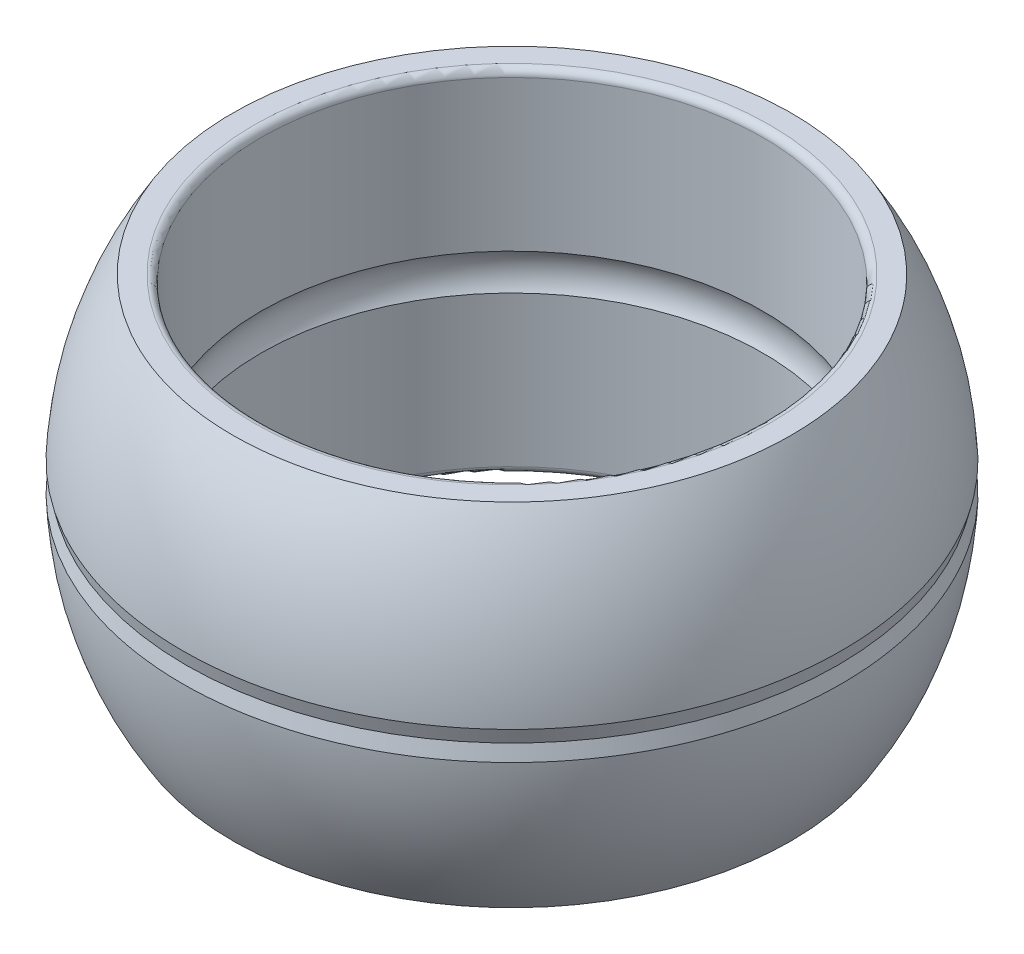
ISO-10303-21;
HEADER;
FILE_DESCRIPTION(('STEP AP214'),'2;1');
FILE_NAME('part.step','',(''),(''),'','','');
FILE_SCHEMA(('AUTOMOTIVE_DESIGN { 1 0 10303 214 1 1 1 1 }'));
ENDSEC;
DATA;
#1=APPLICATION_CONTEXT('core data for automotive mechanical design processes');
#2=APPLICATION_PROTOCOL_DEFINITION('international standard','automotive_design',2000,#1);
#3=PRODUCT_CONTEXT('',#1,'mechanical');
#4=PRODUCT('Part','Part','',(#3));
#5=PRODUCT_RELATED_PRODUCT_CATEGORY('part','',(#4));
#6=PRODUCT_DEFINITION_FORMATION('','',#4);
#7=PRODUCT_DEFINITION_CONTEXT('part definition',#1,'design');
#8=PRODUCT_DEFINITION('design','',#6,#7);
#9=PRODUCT_DEFINITION_SHAPE('','',#8);
#10=(LENGTH_UNIT() NAMED_UNIT(*) SI_UNIT(.MILLI.,.METRE.));
#11=(NAMED_UNIT(*) PLANE_ANGLE_UNIT() SI_UNIT($,.RADIAN.));
#12=(NAMED_UNIT(*) SI_UNIT($,.STERADIAN.) SOLID_ANGLE_UNIT());
#13=UNCERTAINTY_MEASURE_WITH_UNIT(LENGTH_MEASURE(1.E-05),#10,'distance_accuracy_value','');
#14=(GEOMETRIC_REPRESENTATION_CONTEXT(3) GLOBAL_UNCERTAINTY_ASSIGNED_CONTEXT((#13)) GLOBAL_UNIT_ASSIGNED_CONTEXT((#10,
#11,#12)) REPRESENTATION_CONTEXT('',''));
#15=CARTESIAN_POINT('',(0.,0.,0.));
#16=DIRECTION('',(0.,0.,1.));
#17=DIRECTION('',(1.,0.,0.));
#18=AXIS2_PLACEMENT_3D('',#15,#16,#17);
#19=CARTESIAN_POINT('',(0.,-23.5,0.));
#20=DIRECTION('',(0.,1.,0.));
#21=DIRECTION('',(0.,0.,1.));
#22=AXIS2_PLACEMENT_3D('',#19,#20,#21);
#23=CYLINDRICAL_SURFACE('',#22,35.00000000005);
#24=CARTESIAN_POINT('',(0.,-23.5,0.));
#25=DIRECTION('',(0.,1.,0.));
#26=DIRECTION('',(-1.,0.,0.));
#27=AXIS2_PLACEMENT_3D('',#24,#25,#26);
#28=CIRCLE('',#27,35.0000000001);
#29=CARTESIAN_POINT('',(-35.0000000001,-23.5,0.));
#30=VERTEX_POINT('',#29);
#31=EDGE_CURVE('E229',#30,#30,#28,.T.);
#32=ORIENTED_EDGE('',*,*,#31,.F.);
#33=EDGE_LOOP('',(#32));
#34=FACE_BOUND('',#33,.T.);
#35=CARTESIAN_POINT('',(0.,-2.5298221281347,0.));
#36=DIRECTION('',(0.,1.,0.));
#37=DIRECTION('',(-1.,0.,0.));
#38=AXIS2_PLACEMENT_3D('',#35,#36,#37);
#39=CIRCLE('',#38,35.);
#40=CARTESIAN_POINT('',(-35.,-2.5298221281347,0.));
#41=VERTEX_POINT('',#40);
#42=EDGE_CURVE('E105',#41,#41,#39,.F.);
#43=ORIENTED_EDGE('',*,*,#42,.F.);
#44=EDGE_LOOP('',(#43));
#45=FACE_BOUND('',#44,.T.);
#46=ADVANCED_FACE('F14',(#34,#45),#23,.F.);
#47=CARTESIAN_POINT('',(0.,-23.4999999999,0.));
#48=DIRECTION('',(0.,1.,0.));
#49=DIRECTION('',(-1.,0.,0.));
#50=AXIS2_PLACEMENT_3D('',#47,#48,#49);
#51=TOROIDAL_SURFACE('',#50,36.0000000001,1.);
#52=ORIENTED_EDGE('',*,*,#31,.T.);
#53=EDGE_LOOP('',(#52));
#54=FACE_BOUND('',#53,.T.);
#55=CARTESIAN_POINT('',(0.,-24.4999999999,0.));
#56=DIRECTION('',(0.,-1.,0.));
#57=DIRECTION('',(1.,0.,0.));
#58=AXIS2_PLACEMENT_3D('',#55,#56,#57);
#59=CIRCLE('',#58,36.);
#60=CARTESIAN_POINT('',(36.,-24.4999999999,0.));
#61=VERTEX_POINT('',#60);
#62=EDGE_CURVE('E101',#61,#61,#59,.F.);
#63=ORIENTED_EDGE('',*,*,#62,.F.);
#64=EDGE_LOOP('',(#63));
#65=FACE_BOUND('',#64,.T.);
#66=ADVANCED_FACE('F202',(#54,#65),#51,.T.);
#67=CARTESIAN_POINT('',(0.,0.,0.));
#68=DIRECTION('',(0.,1.,0.));
#69=DIRECTION('',(-1.,0.,0.));
#70=AXIS2_PLACEMENT_3D('',#67,#68,#69);
#71=TOROIDAL_SURFACE('',#70,30.6,5.07543101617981);
#72=CARTESIAN_POINT('',(0.,2.5298221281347,0.));
#73=DIRECTION('',(0.,-1.,0.));
#74=DIRECTION('',(1.,0.,0.));
#75=AXIS2_PLACEMENT_3D('',#72,#73,#74);
#76=CIRCLE('',#75,35.);
#77=CARTESIAN_POINT('',(35.,2.5298221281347,0.));
#78=VERTEX_POINT('',#77);
#79=EDGE_CURVE('E97',#78,#78,#76,.T.);
#80=ORIENTED_EDGE('',*,*,#79,.F.);
#81=EDGE_LOOP('',(#80));
#82=FACE_BOUND('',#81,.T.);
#83=ORIENTED_EDGE('',*,*,#42,.T.);
#84=EDGE_LOOP('',(#83));
#85=FACE_BOUND('',#84,.T.);
#86=ADVANCED_FACE('F121',(#82,#85),#71,.F.);
#87=CARTESIAN_POINT('',(37.4663170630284,-24.4999999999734,0.));
#88=DIRECTION('',(0.,-1.,0.));
#89=DIRECTION('',(0.,0.,-1.));
#90=AXIS2_PLACEMENT_3D('',#87,#88,#89);
#91=PLANE('',#90);
#92=ORIENTED_EDGE('',*,*,#62,.T.);
#93=EDGE_LOOP('',(#92));
#94=FACE_BOUND('',#93,.T.);
#95=CARTESIAN_POINT('',(38.9326341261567,-24.4999999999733,0.));
#96=CARTESIAN_POINT('',(38.9326419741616,-24.4999999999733,-1.09382528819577));
#97=CARTESIAN_POINT('',(38.8865180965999,-24.4999999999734,-2.18752178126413));
#98=CARTESIAN_POINT('',(38.7023445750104,-24.4999999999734,-4.36750600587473));
#99=CARTESIAN_POINT('',(38.5642707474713,-24.4999999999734,-5.45379171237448));
#100=CARTESIAN_POINT('',(38.1969408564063,-24.4999999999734,-7.6120567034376));
#101=CARTESIAN_POINT('',(37.9675839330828,-24.4999999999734,-8.68401880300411));
#102=CARTESIAN_POINT('',(37.4193429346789,-24.4999999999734,-10.8047281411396));
#103=CARTESIAN_POINT('',(37.1004648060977,-24.4999999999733,-11.8534769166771));
#104=CARTESIAN_POINT('',(36.3756084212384,-24.4999999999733,-13.9198942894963));
#105=CARTESIAN_POINT('',(35.9696696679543,-24.4999999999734,-14.937576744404));
#106=CARTESIAN_POINT('',(35.0734864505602,-24.4999999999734,-16.9351383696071));
#107=CARTESIAN_POINT('',(34.5832406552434,-24.4999999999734,-17.9150169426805));
#108=CARTESIAN_POINT('',(33.5220694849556,-24.4999999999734,-19.8297407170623));
#109=CARTESIAN_POINT('',(32.951164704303,-24.4999999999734,-20.7645973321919));
#110=CARTESIAN_POINT('',(31.7326415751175,-24.4999999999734,-22.5828963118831));
#111=CARTESIAN_POINT('',(31.0850235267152,-24.4999999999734,-23.4663388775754));
#112=CARTESIAN_POINT('',(29.7176023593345,-24.4999999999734,-25.1756253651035));
#113=CARTESIAN_POINT('',(28.997791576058,-24.4999999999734,-26.0014631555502));
#114=CARTESIAN_POINT('',(27.4911588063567,-24.4999999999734,-27.5895667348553));
#115=CARTESIAN_POINT('',(26.704336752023,-24.4999999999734,-28.3518324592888));
#116=CARTESIAN_POINT('',(25.069243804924,-24.4999999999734,-29.8074003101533));
#117=CARTESIAN_POINT('',(24.2209705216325,-24.4999999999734,-30.5006997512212));
#118=CARTESIAN_POINT('',(22.4690333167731,-24.4999999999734,-31.8133720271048));
#119=CARTESIAN_POINT('',(21.5653694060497,-24.4999999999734,-32.432744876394));
#120=CARTESIAN_POINT('',(19.7090928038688,-24.4999999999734,-33.5931498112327));
#121=CARTESIAN_POINT('',(18.756481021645,-24.4999999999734,-34.1341833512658));
#122=CARTESIAN_POINT('',(16.8090657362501,-24.4999999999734,-35.1340769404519));
#123=CARTESIAN_POINT('',(15.8142622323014,-24.4999999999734,-35.5929369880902));
#124=CARTESIAN_POINT('',(13.7895380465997,-24.4999999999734,-36.4252205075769));
#125=CARTESIAN_POINT('',(12.759617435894,-24.4999999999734,-36.7986441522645));
#126=CARTESIAN_POINT('',(10.6719792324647,-24.4999999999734,-37.457401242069));
#127=CARTESIAN_POINT('',(9.61426163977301,-24.4999999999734,-37.7427346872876));
#128=CARTESIAN_POINT('',(7.47854715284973,-24.4999999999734,-38.2232832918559));
#129=CARTESIAN_POINT('',(6.40055021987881,-24.4999999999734,-38.4184982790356));
#130=CARTESIAN_POINT('',(4.23194294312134,-24.4999999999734,-38.7174212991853));
#131=CARTESIAN_POINT('',(3.14133259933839,-24.4999999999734,-38.8211293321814));
#132=CARTESIAN_POINT('',(0.955254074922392,-24.4999999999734,-38.9363010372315));
#133=CARTESIAN_POINT('',(-0.140214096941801,-24.4999999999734,-38.9477648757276));
#134=CARTESIAN_POINT('',(-2.32822212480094,-24.4999999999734,-38.8783671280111));
#135=CARTESIAN_POINT('',(-3.42076198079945,-24.4999999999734,-38.7975055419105));
#136=CARTESIAN_POINT('',(-5.59514649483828,-24.4999999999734,-38.5440317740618));
#137=CARTESIAN_POINT('',(-6.67699114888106,-24.4999999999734,-38.3714195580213));
#138=CARTESIAN_POINT('',(-8.82229358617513,-24.4999999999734,-37.9356716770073));
#139=CARTESIAN_POINT('',(-9.88575136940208,-24.4999999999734,-37.6725360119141));
#140=CARTESIAN_POINT('',(-11.9867206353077,-24.4999999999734,-37.0576116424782));
#141=CARTESIAN_POINT('',(-13.024232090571,-24.4999999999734,-36.7058228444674));
#142=CARTESIAN_POINT('',(-15.065931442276,-24.4999999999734,-35.9160933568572));
#143=CARTESIAN_POINT('',(-16.0701193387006,-24.4999999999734,-35.4781526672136));
#144=CARTESIAN_POINT('',(-18.0380320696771,-24.4999999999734,-34.519233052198));
#145=CARTESIAN_POINT('',(-19.0017569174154,-24.4999999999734,-33.9982541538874));
#146=CARTESIAN_POINT('',(-20.8818923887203,-24.4999999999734,-32.8769618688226));
#147=CARTESIAN_POINT('',(-21.7983030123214,-24.4999999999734,-32.2766484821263));
#148=CARTESIAN_POINT('',(-23.5772945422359,-24.4999999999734,-31.0009553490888));
#149=CARTESIAN_POINT('',(-24.4398754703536,-24.4999999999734,-30.3255756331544));
#150=CARTESIAN_POINT('',(-26.1050755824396,-24.4999999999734,-28.9045511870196));
#151=CARTESIAN_POINT('',(-26.907694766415,-24.4999999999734,-28.1589064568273));
#152=CARTESIAN_POINT('',(-28.4472653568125,-24.4999999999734,-26.6026529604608));
#153=CARTESIAN_POINT('',(-29.1842167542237,-24.4999999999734,-25.7920441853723));
#154=CARTESIAN_POINT('',(-30.5872123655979,-24.4999999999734,-24.1116256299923));
#155=CARTESIAN_POINT('',(-31.2532565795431,-24.4999999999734,-23.2418158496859));
#156=CARTESIAN_POINT('',(-32.5097027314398,-24.4999999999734,-21.4491789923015));
#157=CARTESIAN_POINT('',(-33.1001046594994,-24.4999999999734,-20.5263519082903));
#158=CARTESIAN_POINT('',(-34.2010687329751,-24.4999999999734,-18.6342412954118));
#159=CARTESIAN_POINT('',(-34.7116308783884,-24.4999999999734,-17.664957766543));
#160=CARTESIAN_POINT('',(-35.6492855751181,-24.4999999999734,-15.6868253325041));
#161=CARTESIAN_POINT('',(-36.0763781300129,-24.4999999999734,-14.6779764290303));
#162=CARTESIAN_POINT('',(-36.8440573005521,-24.4999999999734,-12.6278855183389));
#163=CARTESIAN_POINT('',(-37.1846439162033,-24.4999999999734,-11.5866435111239));
#164=CARTESIAN_POINT('',(-37.7768898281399,-24.4999999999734,-9.47916904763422));
#165=CARTESIAN_POINT('',(-38.0285491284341,-24.4999999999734,-8.41293659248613));
#166=CARTESIAN_POINT('',(-38.4411512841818,-24.4999999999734,-6.26306146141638));
#167=CARTESIAN_POINT('',(-38.6020941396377,-24.4999999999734,-5.17941878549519));
#168=CARTESIAN_POINT('',(-38.8321191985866,-24.4999999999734,-3.00242726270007));
#169=CARTESIAN_POINT('',(-38.9012014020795,-24.4999999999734,-1.90907841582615));
#170=CARTESIAN_POINT('',(-38.9470140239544,-24.4999999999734,0.279552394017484));
#171=CARTESIAN_POINT('',(-38.9237444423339,-24.4999999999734,1.37483435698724));
#172=CARTESIAN_POINT('',(-38.7850189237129,-24.4999999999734,3.55954465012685));
#173=CARTESIAN_POINT('',(-38.6695629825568,-24.4999999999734,4.64897298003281));
#174=CARTESIAN_POINT('',(-38.3472855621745,-24.4999999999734,6.81423077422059));
#175=CARTESIAN_POINT('',(-38.1404640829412,-24.4999999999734,7.89006023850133));
#176=CARTESIAN_POINT('',(-37.6369259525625,-24.4999999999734,10.0204718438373));
#177=CARTESIAN_POINT('',(-37.3402092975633,-24.4999999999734,11.0750539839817));
#178=CARTESIAN_POINT('',(-36.6589902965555,-24.4999999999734,13.1554734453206));
#179=CARTESIAN_POINT('',(-36.2744879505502,-24.4999999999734,14.1813107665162));
#180=CARTESIAN_POINT('',(-35.4204312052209,-24.4999999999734,16.1969473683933));
#181=CARTESIAN_POINT('',(-34.9508768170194,-24.4999999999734,17.1867466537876));
#182=CARTESIAN_POINT('',(-33.9300542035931,-24.4999999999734,19.1232704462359));
#183=CARTESIAN_POINT('',(-33.3787859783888,-24.4999999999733,20.0699949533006));
#184=CARTESIAN_POINT('',(-32.1984549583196,-24.4999999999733,21.9136384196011));
#185=CARTESIAN_POINT('',(-31.5693921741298,-24.4999999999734,22.810557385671));
#186=CARTESIAN_POINT('',(-30.2379442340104,-24.4999999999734,24.5482133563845));
#187=CARTESIAN_POINT('',(-29.5355590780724,-24.4999999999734,25.3889503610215));
#188=CARTESIAN_POINT('',(-28.0624596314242,-24.4999999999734,27.0082656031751));
#189=CARTESIAN_POINT('',(-27.2917453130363,-24.4999999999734,27.7868438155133));
#190=CARTESIAN_POINT('',(-25.6874671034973,-24.4999999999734,29.2763058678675));
#191=CARTESIAN_POINT('',(-24.8539032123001,-24.4999999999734,29.9871897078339));
#192=CARTESIAN_POINT('',(-23.1298517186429,-24.4999999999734,31.3362092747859));
#193=CARTESIAN_POINT('',(-22.239364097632,-24.4999999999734,31.9743449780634));
#194=CARTESIAN_POINT('',(-20.4077962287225,-24.4999999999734,33.173331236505));
#195=CARTESIAN_POINT('',(-19.4667159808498,-24.4999999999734,33.7341817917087));
#196=CARTESIAN_POINT('',(-17.5406544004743,-24.4999999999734,34.7746098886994));
#197=CARTESIAN_POINT('',(-16.5556731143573,-24.4999999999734,35.2541875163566));
#198=CARTESIAN_POINT('',(-14.5488111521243,-24.4999999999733,36.1286609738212));
#199=CARTESIAN_POINT('',(-13.5269304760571,-24.4999999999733,36.5235568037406));
#200=CARTESIAN_POINT('',(-11.4535350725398,-24.4999999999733,37.2258590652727));
#201=CARTESIAN_POINT('',(-10.4020203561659,-24.4999999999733,37.5332655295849));
#202=CARTESIAN_POINT('',(-8.2768321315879,-24.4999999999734,38.0584037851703));
#203=CARTESIAN_POINT('',(-7.20315862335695,-24.4999999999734,38.2761355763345));
#204=CARTESIAN_POINT('',(-5.04128402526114,-24.4999999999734,38.6203768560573));
#205=CARTESIAN_POINT('',(-3.9530829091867,-24.4999999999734,38.7468861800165));
#206=CARTESIAN_POINT('',(-1.76989146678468,-24.4999999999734,38.9077824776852));
#207=CARTESIAN_POINT('',(-0.674901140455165,-24.4999999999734,38.9421694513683));
#208=CARTESIAN_POINT('',(1.51408189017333,-24.4999999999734,38.9185766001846));
#209=CARTESIAN_POINT('',(2.60807459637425,-24.4999999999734,38.860596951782));
#210=CARTESIAN_POINT('',(4.78728686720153,-24.4999999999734,38.6526833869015));
#211=CARTESIAN_POINT('',(5.87250643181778,-24.4999999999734,38.5027494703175));
#212=CARTESIAN_POINT('',(8.02645935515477,-24.4999999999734,38.1119929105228));
#213=CARTESIAN_POINT('',(9.09519268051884,-24.4999999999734,37.8711700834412));
#214=CARTESIAN_POINT('',(11.2085727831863,-24.4999999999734,37.3003478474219));
#215=CARTESIAN_POINT('',(12.2532195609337,-24.4999999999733,36.9703484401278));
#216=CARTESIAN_POINT('',(14.3110188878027,-24.4999999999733,36.2235122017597));
#217=CARTESIAN_POINT('',(15.3241708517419,-24.4999999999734,35.8066737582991));
#218=CARTESIAN_POINT('',(17.3117572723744,-24.4999999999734,34.8891266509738));
#219=CARTESIAN_POINT('',(18.2861917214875,-24.4999999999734,34.3884179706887));
#220=CARTESIAN_POINT('',(20.1893779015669,-24.4999999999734,33.3067114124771));
#221=CARTESIAN_POINT('',(21.1181314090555,-24.4999999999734,32.725716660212));
#222=CARTESIAN_POINT('',(22.9233928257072,-24.4999999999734,31.4875541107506));
#223=CARTESIAN_POINT('',(23.7999007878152,-24.4999999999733,30.8303863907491));
#224=CARTESIAN_POINT('',(25.4943508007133,-24.4999999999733,29.4446230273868));
#225=CARTESIAN_POINT('',(26.3122990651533,-24.4999999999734,28.7160349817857));
#226=CARTESIAN_POINT('',(27.883921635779,-24.4999999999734,27.1925480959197));
#227=CARTESIAN_POINT('',(28.6375956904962,-24.4999999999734,26.3976489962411));
#228=CARTESIAN_POINT('',(30.0754928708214,-24.4999999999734,24.7469815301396));
#229=CARTESIAN_POINT('',(30.7596982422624,-24.4999999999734,23.8911976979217));
#230=CARTESIAN_POINT('',(32.0535631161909,-24.4999999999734,22.1250407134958));
#231=CARTESIAN_POINT('',(32.6632237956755,-24.4999999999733,21.2146684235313));
#232=CARTESIAN_POINT('',(33.8039353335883,-24.4999999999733,19.3453705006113));
#233=CARTESIAN_POINT('',(34.3349504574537,-24.4999999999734,18.3864230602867));
#234=CARTESIAN_POINT('',(35.3142931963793,-24.4999999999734,16.4271211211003));
#235=CARTESIAN_POINT('',(35.7626153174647,-24.4999999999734,15.4267638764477));
#236=CARTESIAN_POINT('',(36.5728906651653,-24.4999999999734,13.3929268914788));
#237=CARTESIAN_POINT('',(36.9349389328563,-24.4999999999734,12.3594850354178));
#238=CARTESIAN_POINT('',(37.5706415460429,-24.4999999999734,10.266130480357));
#239=CARTESIAN_POINT('',(37.8443191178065,-24.4999999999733,9.20622481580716));
#240=CARTESIAN_POINT('',(38.3583881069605,-24.4999999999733,6.80068626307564));
#241=CARTESIAN_POINT('',(38.5735476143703,-24.4999999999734,5.44958736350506));
#242=CARTESIAN_POINT('',(38.8606657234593,-24.4999999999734,2.73225868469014));
#243=CARTESIAN_POINT('',(38.9326243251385,-24.4999999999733,1.36602890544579));
#244=CARTESIAN_POINT('',(38.9326341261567,-24.4999999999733,0.));
#245=B_SPLINE_CURVE_WITH_KNOTS('',3,(#95,#96,#97,#98,#99,#100,#101,#102,#103,#104,#105,#106,
#107,#108,#109,#110,#111,#112,#113,#114,#115,#116,#117,#118,#119,#120,#121,#122,#123,#124,#125,
#126,#127,#128,#129,#130,#131,#132,#133,#134,#135,#136,#137,#138,#139,#140,#141,#142,#143,#144,
#145,#146,#147,#148,#149,#150,#151,#152,#153,#154,#155,#156,#157,#158,#159,#160,#161,#162,#163,
#164,#165,#166,#167,#168,#169,#170,#171,#172,#173,#174,#175,#176,#177,#178,#179,#180,#181,#182,
#183,#184,#185,#186,#187,#188,#189,#190,#191,#192,#193,#194,#195,#196,#197,#198,#199,#200,#201,
#202,#203,#204,#205,#206,#207,#208,#209,#210,#211,#212,#213,#214,#215,#216,#217,#218,#219,#220,
#221,#222,#223,#224,#225,#226,#227,#228,#229,#230,#231,#232,#233,#234,#235,#236,#237,#238,#239,
#240,#241,#242,#243,#244),.UNSPECIFIED.,.T.,.F.,(4,2,2,2,2,2,2,2,2,2,2,2,2,2,2,2,2,2,2,2,2,2,2,
2,2,2,2,2,2,2,2,2,2,2,2,2,2,2,2,2,2,2,2,2,2,2,2,2,2,2,2,2,2,2,2,2,2,2,2,2,2,2,2,2,2,2,2,2,2,2,2,
2,2,2,4),(0.,3.28028263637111,6.56142835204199,9.84620955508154,13.1307726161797,
16.4138484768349,19.6969761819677,22.9792671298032,26.2615452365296,29.5441721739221,
32.8268024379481,36.1095604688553,39.3923178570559,42.6750142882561,45.9577107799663,
49.240400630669,52.5230904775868,55.8057865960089,59.0884827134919,62.3711729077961,
65.6538630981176,68.9365545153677,72.2192459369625,75.5019408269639,78.7846357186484,
82.0673295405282,85.3500233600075,88.6327158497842,91.9154083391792,95.1981012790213,
98.4807942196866,101.763487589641,105.04618095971,108.328874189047,111.611567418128,
114.894260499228,118.176953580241,121.459646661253,124.742339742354,128.025032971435,
131.307726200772,134.590419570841,137.873112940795,141.15580588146,144.438498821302,
147.721191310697,151.003883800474,154.286577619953,157.569271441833,160.851966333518,
164.134661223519,167.417352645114,170.700044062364,173.982734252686,177.26542444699,
180.548120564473,183.830816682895,187.113506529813,190.396196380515,193.678892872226,
196.961589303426,200.244346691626,203.527104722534,206.80973498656,210.092361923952,
213.374640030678,216.656930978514,219.940058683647,223.223134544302,226.5076976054,
229.79247880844,233.073624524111,236.353907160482,240.450503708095,244.547100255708),.UNSPECIFIED.);
#246=CARTESIAN_POINT('',(38.9326341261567,-24.4999999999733,0.));
#247=VERTEX_POINT('',#246);
#248=EDGE_CURVE('E20',#247,#247,#245,.T.);
#249=ORIENTED_EDGE('',*,*,#248,.F.);
#250=EDGE_LOOP('',(#249));
#251=FACE_BOUND('',#250,.T.);
#252=ADVANCED_FACE('F111',(#94,#251),#91,.T.);
#253=CARTESIAN_POINT('',(0.,2.5298221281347,0.));
#254=DIRECTION('',(0.,1.,0.));
#255=DIRECTION('',(0.,0.,1.));
#256=AXIS2_PLACEMENT_3D('',#253,#254,#255);
#257=CYLINDRICAL_SURFACE('',#256,35.);
#258=ORIENTED_EDGE('',*,*,#79,.T.);
#259=EDGE_LOOP('',(#258));
#260=FACE_BOUND('',#259,.T.);
#261=CARTESIAN_POINT('',(0.,23.5,0.));
#262=DIRECTION('',(0.,1.,0.));
#263=DIRECTION('',(-1.,0.,0.));
#264=AXIS2_PLACEMENT_3D('',#261,#262,#263);
#265=CIRCLE('',#264,35.0000000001);
#266=CARTESIAN_POINT('',(-35.0000000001,23.5,0.));
#267=VERTEX_POINT('',#266);
#268=EDGE_CURVE('E91',#267,#267,#265,.F.);
#269=ORIENTED_EDGE('',*,*,#268,.F.);
#270=EDGE_LOOP('',(#269));
#271=FACE_BOUND('',#270,.T.);
#272=ADVANCED_FACE('F120',(#260,#271),#257,.F.);
#273=CARTESIAN_POINT('',(-9.86588588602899E-11,3.08819636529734E-11,0.));
#274=DIRECTION('',(0.457831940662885,0.797007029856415,0.39391586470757));
#275=DIRECTION('',(-0.209259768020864,-0.334023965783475,0.919042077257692));
#276=AXIS2_PLACEMENT_3D('',#273,#274,#275);
#277=SPHERICAL_SURFACE('',#276,46.0000000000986);
#278=ORIENTED_EDGE('',*,*,#248,.T.);
#279=EDGE_LOOP('',(#278));
#280=FACE_BOUND('',#279,.T.);
#281=CARTESIAN_POINT('',(0.,-2.,0.));
#282=DIRECTION('',(0.,-1.,0.));
#283=DIRECTION('',(0.,0.,-1.));
#284=AXIS2_PLACEMENT_3D('',#281,#282,#283);
#285=CIRCLE('',#284,45.9565011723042);
#286=CARTESIAN_POINT('',(0.,-2.,-45.9565011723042));
#287=VERTEX_POINT('',#286);
#288=EDGE_CURVE('E43',#287,#287,#285,.F.);
#289=ORIENTED_EDGE('',*,*,#288,.F.);
#290=EDGE_LOOP('',(#289));
#291=FACE_BOUND('',#290,.T.);
#292=ADVANCED_FACE('F84',(#280,#291),#277,.T.);
#293=CARTESIAN_POINT('',(0.,23.4999999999,0.));
#294=DIRECTION('',(0.,1.,0.));
#295=DIRECTION('',(-1.,0.,0.));
#296=AXIS2_PLACEMENT_3D('',#293,#294,#295);
#297=TOROIDAL_SURFACE('',#296,36.0000000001,1.00000000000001);
#298=CARTESIAN_POINT('',(0.,24.4999999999,0.));
#299=DIRECTION('',(0.,1.,0.));
#300=DIRECTION('',(1.,0.,0.));
#301=AXIS2_PLACEMENT_3D('',#298,#299,#300);
#302=CIRCLE('',#301,36.);
#303=CARTESIAN_POINT('',(36.,24.4999999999,0.));
#304=VERTEX_POINT('',#303);
#305=EDGE_CURVE('E68',#304,#304,#302,.F.);
#306=ORIENTED_EDGE('',*,*,#305,.F.);
#307=EDGE_LOOP('',(#306));
#308=FACE_BOUND('',#307,.T.);
#309=ORIENTED_EDGE('',*,*,#268,.T.);
#310=EDGE_LOOP('',(#309));
#311=FACE_BOUND('',#310,.T.);
#312=ADVANCED_FACE('F75',(#308,#311),#297,.T.);
#313=CARTESIAN_POINT('',(0.,-2.00000000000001,0.));
#314=DIRECTION('',(0.,-1.,0.));
#315=DIRECTION('',(0.,0.,-1.));
#316=AXIS2_PLACEMENT_3D('',#313,#314,#315);
#317=CONICAL_SURFACE('',#316,45.9565011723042,0.241398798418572);
#318=CARTESIAN_POINT('',(0.,1.14630527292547E-11,0.));
#319=DIRECTION('',(0.,1.,0.));
#320=DIRECTION('',(1.,0.,0.));
#321=AXIS2_PLACEMENT_3D('',#318,#319,#320);
#322=CIRCLE('',#321,45.4641016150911);
#323=CARTESIAN_POINT('',(45.4641016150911,1.14723768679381E-11,0.));
#324=VERTEX_POINT('',#323);
#325=EDGE_CURVE('E33',#324,#324,#322,.T.);
#326=ORIENTED_EDGE('',*,*,#325,.F.);
#327=EDGE_LOOP('',(#326));
#328=FACE_BOUND('',#327,.T.);
#329=ORIENTED_EDGE('',*,*,#288,.T.);
#330=EDGE_LOOP('',(#329));
#331=FACE_BOUND('',#330,.T.);
#332=ADVANCED_FACE('F49',(#328,#331),#317,.T.);
#333=CARTESIAN_POINT('',(37.4663170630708,24.49999999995,0.));
#334=DIRECTION('',(0.,1.,0.));
#335=DIRECTION('',(0.,0.,1.));
#336=AXIS2_PLACEMENT_3D('',#333,#334,#335);
#337=PLANE('',#336);
#338=CARTESIAN_POINT('',(38.9326341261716,24.49999999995,0.));
#339=CARTESIAN_POINT('',(38.9326419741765,24.49999999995,1.09382528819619));
#340=CARTESIAN_POINT('',(38.8865180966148,24.49999999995,2.18752178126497));
#341=CARTESIAN_POINT('',(38.7023445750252,24.49999999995,4.36750600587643));
#342=CARTESIAN_POINT('',(38.5642707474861,24.49999999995,5.4537917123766));
#343=CARTESIAN_POINT('',(38.1969408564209,24.49999999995,7.61205670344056));
#344=CARTESIAN_POINT('',(37.9675839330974,24.49999999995,8.68401880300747));
#345=CARTESIAN_POINT('',(37.4193429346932,24.49999999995,10.8047281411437));
#346=CARTESIAN_POINT('',(37.1004648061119,24.49999999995,11.8534769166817));
#347=CARTESIAN_POINT('',(36.3756084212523,24.49999999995,13.9198942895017));
#348=CARTESIAN_POINT('',(35.969669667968,24.49999999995,14.9375767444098));
#349=CARTESIAN_POINT('',(35.0734864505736,24.49999999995,16.9351383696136));
#350=CARTESIAN_POINT('',(34.5832406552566,24.49999999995,17.9150169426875));
#351=CARTESIAN_POINT('',(33.5220694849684,24.49999999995,19.82974071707));
#352=CARTESIAN_POINT('',(32.9511647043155,24.49999999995,20.7645973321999));
#353=CARTESIAN_POINT('',(31.7326415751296,24.49999999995,22.5828963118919));
#354=CARTESIAN_POINT('',(31.0850235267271,24.49999999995,23.4663388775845));
#355=CARTESIAN_POINT('',(29.7176023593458,24.49999999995,25.1756253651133));
#356=CARTESIAN_POINT('',(28.997791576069,24.49999999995,26.0014631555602));
#357=CARTESIAN_POINT('',(27.4911588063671,24.49999999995,27.589566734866));
#358=CARTESIAN_POINT('',(26.7043367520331,24.49999999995,28.3518324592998));
#359=CARTESIAN_POINT('',(25.0692438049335,24.49999999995,29.8074003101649));
#360=CARTESIAN_POINT('',(24.2209705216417,24.49999999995,30.500699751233));
#361=CARTESIAN_POINT('',(22.4690333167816,24.49999999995,31.8133720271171));
#362=CARTESIAN_POINT('',(21.5653694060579,24.49999999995,32.4327448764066));
#363=CARTESIAN_POINT('',(19.7090928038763,24.49999999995,33.5931498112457));
#364=CARTESIAN_POINT('',(18.7564810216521,24.49999999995,34.1341833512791));
#365=CARTESIAN_POINT('',(16.8090657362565,24.49999999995,35.1340769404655));
#366=CARTESIAN_POINT('',(15.8142622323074,24.49999999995,35.592936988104));
#367=CARTESIAN_POINT('',(13.7895380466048,24.49999999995,36.4252205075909));
#368=CARTESIAN_POINT('',(12.7596174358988,24.49999999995,36.7986441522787));
#369=CARTESIAN_POINT('',(10.6719792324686,24.49999999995,37.4574012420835));
#370=CARTESIAN_POINT('',(9.61426163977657,24.49999999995,37.7427346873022));
#371=CARTESIAN_POINT('',(7.47854715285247,24.49999999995,38.2232832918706));
#372=CARTESIAN_POINT('',(6.40055021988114,24.49999999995,38.4184982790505));
#373=CARTESIAN_POINT('',(4.23194294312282,24.49999999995,38.7174212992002));
#374=CARTESIAN_POINT('',(3.14133259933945,24.49999999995,38.8211293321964));
#375=CARTESIAN_POINT('',(0.955254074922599,24.49999999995,38.9363010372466));
#376=CARTESIAN_POINT('',(-0.14021409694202,24.49999999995,38.9477648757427));
#377=CARTESIAN_POINT('',(-2.32822212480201,24.49999999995,38.8783671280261));
#378=CARTESIAN_POINT('',(-3.42076198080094,24.49999999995,38.7975055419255));
#379=CARTESIAN_POINT('',(-5.59514649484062,24.49999999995,38.5440317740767));
#380=CARTESIAN_POINT('',(-6.67699114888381,24.49999999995,38.3714195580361));
#381=CARTESIAN_POINT('',(-8.8222935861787,24.49999999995,37.935671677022));
#382=CARTESIAN_POINT('',(-9.88575136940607,24.49999999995,37.6725360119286));
#383=CARTESIAN_POINT('',(-11.9867206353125,24.49999999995,37.0576116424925));
#384=CARTESIAN_POINT('',(-13.0242320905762,24.49999999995,36.7058228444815));
#385=CARTESIAN_POINT('',(-15.065931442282,24.49999999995,35.9160933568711));
#386=CARTESIAN_POINT('',(-16.070119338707,24.49999999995,35.4781526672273));
#387=CARTESIAN_POINT('',(-18.0380320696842,24.49999999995,34.5192330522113));
#388=CARTESIAN_POINT('',(-19.0017569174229,24.49999999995,33.9982541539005));
#389=CARTESIAN_POINT('',(-20.8818923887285,24.49999999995,32.8769618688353));
#390=CARTESIAN_POINT('',(-21.79830301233,24.49999999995,32.2766484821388));
#391=CARTESIAN_POINT('',(-23.5772945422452,24.49999999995,31.0009553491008));
#392=CARTESIAN_POINT('',(-24.4398754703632,24.49999999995,30.3255756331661));
#393=CARTESIAN_POINT('',(-26.1050755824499,24.49999999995,28.9045511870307));
#394=CARTESIAN_POINT('',(-26.9076947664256,24.49999999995,28.1589064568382));
#395=CARTESIAN_POINT('',(-28.4472653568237,24.49999999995,26.6026529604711));
#396=CARTESIAN_POINT('',(-29.1842167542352,24.49999999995,25.7920441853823));
#397=CARTESIAN_POINT('',(-30.5872123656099,24.49999999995,24.1116256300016));
#398=CARTESIAN_POINT('',(-31.2532565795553,24.49999999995,23.2418158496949));
#399=CARTESIAN_POINT('',(-32.5097027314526,24.49999999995,21.4491789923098));
#400=CARTESIAN_POINT('',(-33.1001046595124,24.49999999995,20.5263519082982));
#401=CARTESIAN_POINT('',(-34.2010687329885,24.49999999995,18.6342412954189));
#402=CARTESIAN_POINT('',(-34.711630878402,24.49999999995,17.6649577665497));
#403=CARTESIAN_POINT('',(-35.649285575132,24.49999999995,15.6868253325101));
#404=CARTESIAN_POINT('',(-36.076378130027,24.49999999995,14.677976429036));
#405=CARTESIAN_POINT('',(-36.8440573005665,24.49999999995,12.6278855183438));
#406=CARTESIAN_POINT('',(-37.1846439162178,24.49999999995,11.5866435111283));
#407=CARTESIAN_POINT('',(-37.7768898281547,24.49999999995,9.47916904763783));
#408=CARTESIAN_POINT('',(-38.028549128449,24.49999999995,8.41293659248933));
#409=CARTESIAN_POINT('',(-38.4411512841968,24.49999999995,6.26306146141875));
#410=CARTESIAN_POINT('',(-38.6020941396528,24.49999999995,5.17941878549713));
#411=CARTESIAN_POINT('',(-38.8321191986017,24.49999999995,3.00242726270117));
#412=CARTESIAN_POINT('',(-38.9012014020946,24.49999999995,1.90907841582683));
#413=CARTESIAN_POINT('',(-38.9470140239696,24.49999999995,-0.279552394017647));
#414=CARTESIAN_POINT('',(-38.9237444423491,24.49999999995,-1.37483435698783));
#415=CARTESIAN_POINT('',(-38.7850189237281,24.49999999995,-3.55954465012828));
#416=CARTESIAN_POINT('',(-38.6695629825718,24.49999999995,-4.64897298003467));
#417=CARTESIAN_POINT('',(-38.3472855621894,24.49999999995,-6.81423077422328));
#418=CARTESIAN_POINT('',(-38.1404640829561,24.49999999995,-7.89006023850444));
#419=CARTESIAN_POINT('',(-37.6369259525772,24.49999999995,-10.0204718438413));
#420=CARTESIAN_POINT('',(-37.3402092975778,24.49999999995,-11.075053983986));
#421=CARTESIAN_POINT('',(-36.6589902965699,24.49999999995,-13.1554734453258));
#422=CARTESIAN_POINT('',(-36.2744879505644,24.49999999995,-14.1813107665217));
#423=CARTESIAN_POINT('',(-35.4204312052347,24.49999999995,-16.1969473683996));
#424=CARTESIAN_POINT('',(-34.950876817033,24.49999999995,-17.1867466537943));
#425=CARTESIAN_POINT('',(-33.9300542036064,24.49999999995,-19.1232704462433));
#426=CARTESIAN_POINT('',(-33.3787859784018,24.49999999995,-20.0699949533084));
#427=CARTESIAN_POINT('',(-32.1984549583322,24.49999999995,-21.9136384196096));
#428=CARTESIAN_POINT('',(-31.5693921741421,24.49999999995,-22.8105573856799));
#429=CARTESIAN_POINT('',(-30.2379442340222,24.49999999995,-24.548213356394));
#430=CARTESIAN_POINT('',(-29.5355590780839,24.49999999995,-25.3889503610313));
#431=CARTESIAN_POINT('',(-28.0624596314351,24.49999999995,-27.0082656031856));
#432=CARTESIAN_POINT('',(-27.291745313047,24.49999999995,-27.7868438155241));
#433=CARTESIAN_POINT('',(-25.6874671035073,24.49999999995,-29.2763058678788));
#434=CARTESIAN_POINT('',(-24.8539032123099,24.49999999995,-29.9871897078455));
#435=CARTESIAN_POINT('',(-23.129851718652,24.49999999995,-31.3362092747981));
#436=CARTESIAN_POINT('',(-22.2393640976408,24.49999999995,-31.9743449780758));
#437=CARTESIAN_POINT('',(-20.4077962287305,24.49999999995,-33.1733312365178));
#438=CARTESIAN_POINT('',(-19.4667159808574,24.49999999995,-33.7341817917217));
#439=CARTESIAN_POINT('',(-17.5406544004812,24.49999999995,-34.7746098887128));
#440=CARTESIAN_POINT('',(-16.5556731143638,24.49999999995,-35.2541875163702));
#441=CARTESIAN_POINT('',(-14.54881115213,24.49999999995,-36.1286609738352));
#442=CARTESIAN_POINT('',(-13.5269304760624,24.49999999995,-36.5235568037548));
#443=CARTESIAN_POINT('',(-11.4535350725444,24.49999999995,-37.2258590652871));
#444=CARTESIAN_POINT('',(-10.40202035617,24.49999999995,-37.5332655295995));
#445=CARTESIAN_POINT('',(-8.27683213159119,24.49999999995,-38.058403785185));
#446=CARTESIAN_POINT('',(-7.20315862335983,24.49999999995,-38.2761355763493));
#447=CARTESIAN_POINT('',(-5.04128402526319,24.49999999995,-38.6203768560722));
#448=CARTESIAN_POINT('',(-3.95308290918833,24.49999999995,-38.7468861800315));
#449=CARTESIAN_POINT('',(-1.76989146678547,24.49999999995,-38.9077824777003));
#450=CARTESIAN_POINT('',(-0.674901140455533,24.49999999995,-38.9421694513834));
#451=CARTESIAN_POINT('',(1.51408189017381,24.49999999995,-38.9185766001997));
#452=CARTESIAN_POINT('',(2.60807459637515,24.49999999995,-38.860596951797));
#453=CARTESIAN_POINT('',(4.78728686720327,24.49999999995,-38.6526833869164));
#454=CARTESIAN_POINT('',(5.87250643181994,24.49999999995,-38.5027494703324));
#455=CARTESIAN_POINT('',(8.02645935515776,24.49999999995,-38.1119929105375));
#456=CARTESIAN_POINT('',(9.09519268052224,24.49999999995,-37.8711700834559));
#457=CARTESIAN_POINT('',(11.2085727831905,24.49999999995,-37.3003478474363));
#458=CARTESIAN_POINT('',(12.2532195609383,24.49999999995,-36.9703484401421));
#459=CARTESIAN_POINT('',(14.3110188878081,24.49999999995,-36.2235122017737));
#460=CARTESIAN_POINT('',(15.3241708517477,24.49999999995,-35.8066737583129));
#461=CARTESIAN_POINT('',(17.311757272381,24.49999999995,-34.8891266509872));
#462=CARTESIAN_POINT('',(18.2861917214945,24.49999999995,-34.388417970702));
#463=CARTESIAN_POINT('',(20.1893779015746,24.49999999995,-33.30671141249));
#464=CARTESIAN_POINT('',(21.1181314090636,24.49999999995,-32.7257166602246));
#465=CARTESIAN_POINT('',(22.9233928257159,24.49999999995,-31.4875541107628));
#466=CARTESIAN_POINT('',(23.7999007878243,24.49999999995,-30.830386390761));
#467=CARTESIAN_POINT('',(25.494350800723,24.49999999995,-29.4446230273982));
#468=CARTESIAN_POINT('',(26.3122990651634,24.49999999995,-28.7160349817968));
#469=CARTESIAN_POINT('',(27.8839216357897,24.49999999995,-27.1925480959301));
#470=CARTESIAN_POINT('',(28.6375956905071,24.49999999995,-26.3976489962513));
#471=CARTESIAN_POINT('',(30.0754928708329,24.49999999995,-24.7469815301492));
#472=CARTESIAN_POINT('',(30.7596982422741,24.49999999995,-23.8911976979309));
#473=CARTESIAN_POINT('',(32.0535631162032,24.49999999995,-22.1250407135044));
#474=CARTESIAN_POINT('',(32.663223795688,24.49999999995,-21.2146684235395));
#475=CARTESIAN_POINT('',(33.8039353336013,24.49999999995,-19.3453705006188));
#476=CARTESIAN_POINT('',(34.3349504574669,24.49999999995,-18.3864230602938));
#477=CARTESIAN_POINT('',(35.3142931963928,24.49999999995,-16.4271211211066));
#478=CARTESIAN_POINT('',(35.7626153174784,24.49999999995,-15.4267638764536));
#479=CARTESIAN_POINT('',(36.5728906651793,24.49999999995,-13.392926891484));
#480=CARTESIAN_POINT('',(36.9349389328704,24.49999999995,-12.3594850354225));
#481=CARTESIAN_POINT('',(37.5706415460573,24.49999999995,-10.266130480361));
#482=CARTESIAN_POINT('',(37.844319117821,24.49999999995,-9.2062248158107));
#483=CARTESIAN_POINT('',(38.3583881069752,24.49999999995,-6.80068626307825));
#484=CARTESIAN_POINT('',(38.5735476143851,24.49999999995,-5.44958736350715));
#485=CARTESIAN_POINT('',(38.8606657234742,24.49999999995,-2.73225868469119));
#486=CARTESIAN_POINT('',(38.9326243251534,24.49999999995,-1.36602890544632));
#487=CARTESIAN_POINT('',(38.9326341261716,24.49999999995,0.));
#488=B_SPLINE_CURVE_WITH_KNOTS('',3,(#338,#339,#340,#341,#342,#343,#344,#345,#346,#347,#348,
#349,#350,#351,#352,#353,#354,#355,#356,#357,#358,#359,#360,#361,#362,#363,#364,#365,#366,#367,
#368,#369,#370,#371,#372,#373,#374,#375,#376,#377,#378,#379,#380,#381,#382,#383,#384,#385,#386,
#387,#388,#389,#390,#391,#392,#393,#394,#395,#396,#397,#398,#399,#400,#401,#402,#403,#404,#405,
#406,#407,#408,#409,#410,#411,#412,#413,#414,#415,#416,#417,#418,#419,#420,#421,#422,#423,#424,
#425,#426,#427,#428,#429,#430,#431,#432,#433,#434,#435,#436,#437,#438,#439,#440,#441,#442,#443,
#444,#445,#446,#447,#448,#449,#450,#451,#452,#453,#454,#455,#456,#457,#458,#459,#460,#461,#462,
#463,#464,#465,#466,#467,#468,#469,#470,#471,#472,#473,#474,#475,#476,#477,#478,#479,#480,#481,
#482,#483,#484,#485,#486,#487),.UNSPECIFIED.,.T.,.F.,(4,2,2,2,2,2,2,2,2,2,2,2,2,2,2,2,2,2,2,2,2,
2,2,2,2,2,2,2,2,2,2,2,2,2,2,2,2,2,2,2,2,2,2,2,2,2,2,2,2,2,2,2,2,2,2,2,2,2,2,2,2,2,2,2,2,2,2,2,2,
2,2,2,2,2,4),(0.,3.28028263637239,6.56142835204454,9.84620955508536,13.1307726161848,
16.4138484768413,19.6969761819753,22.9792671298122,26.2615452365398,29.5441721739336,
32.8268024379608,36.1095604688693,39.3923178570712,42.6750142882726,45.9577107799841,
49.240400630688,52.5230904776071,55.8057865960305,59.0884827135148,62.3711729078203,
65.653863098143,68.9365545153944,72.2192459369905,75.5019408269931,78.7846357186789,
82.06732954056,85.3500233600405,88.6327158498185,91.9154083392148,95.1981012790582,
98.4807942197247,101.76348758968,105.046180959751,108.328874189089,111.611567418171,
114.894260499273,118.176953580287,121.4596466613,124.742339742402,128.025032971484,
131.307726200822,134.590419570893,137.873112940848,141.155805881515,144.438498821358,
147.721191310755,151.003883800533,154.286577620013,157.569271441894,160.85196633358,
164.134661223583,167.417352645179,170.70004406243,173.982734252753,177.265424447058,
180.548120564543,183.830816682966,187.113506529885,190.396196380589,193.678892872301,
196.961589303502,200.244346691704,203.527104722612,206.80973498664,210.092361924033,
213.374640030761,216.656930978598,219.940058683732,223.223134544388,226.507697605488,
229.792478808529,233.073624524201,236.353907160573,240.450503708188,244.547100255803),.UNSPECIFIED.);
#489=CARTESIAN_POINT('',(38.9326341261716,24.49999999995,0.));
#490=VERTEX_POINT('',#489);
#491=EDGE_CURVE('E28',#490,#490,#488,.T.);
#492=ORIENTED_EDGE('',*,*,#491,.F.);
#493=EDGE_LOOP('',(#492));
#494=FACE_BOUND('',#493,.T.);
#495=ORIENTED_EDGE('',*,*,#305,.T.);
#496=EDGE_LOOP('',(#495));
#497=FACE_BOUND('',#496,.T.);
#498=ADVANCED_FACE('F44',(#494,#497),#337,.T.);
#499=CARTESIAN_POINT('',(0.,1.99999999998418,0.));
#500=DIRECTION('',(0.,1.,0.));
#501=DIRECTION('',(0.,0.,1.));
#502=AXIS2_PLACEMENT_3D('',#499,#500,#501);
#503=CONICAL_SURFACE('',#502,45.9565011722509,0.241398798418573);
#504=CARTESIAN_POINT('',(0.,1.99999999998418,0.));
#505=DIRECTION('',(0.,1.,0.));
#506=DIRECTION('',(0.,0.,1.));
#507=AXIS2_PLACEMENT_3D('',#504,#505,#506);
#508=CIRCLE('',#507,45.9565011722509);
#509=CARTESIAN_POINT('',(0.,1.99999999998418,45.9565011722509));
#510=VERTEX_POINT('',#509);
#511=EDGE_CURVE('E10',#510,#510,#508,.T.);
#512=ORIENTED_EDGE('',*,*,#511,.F.);
#513=EDGE_LOOP('',(#512));
#514=FACE_BOUND('',#513,.T.);
#515=ORIENTED_EDGE('',*,*,#325,.T.);
#516=EDGE_LOOP('',(#515));
#517=FACE_BOUND('',#516,.T.);
#518=ADVANCED_FACE('F48',(#514,#517),#503,.T.);
#519=CARTESIAN_POINT('',(-9.88009674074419E-11,-3.07593950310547E-11,0.));
#520=DIRECTION('',(0.457831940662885,0.797007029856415,0.39391586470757));
#521=DIRECTION('',(-0.209259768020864,-0.334023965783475,0.919042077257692));
#522=AXIS2_PLACEMENT_3D('',#519,#520,#521);
#523=SPHERICAL_SURFACE('',#522,46.0000000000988);
#524=ORIENTED_EDGE('',*,*,#511,.T.);
#525=EDGE_LOOP('',(#524));
#526=FACE_BOUND('',#525,.T.);
#527=ORIENTED_EDGE('',*,*,#491,.T.);
#528=EDGE_LOOP('',(#527));
#529=FACE_BOUND('',#528,.T.);
#530=ADVANCED_FACE('F16',(#526,#529),#523,.T.);
#531=CLOSED_SHELL('',(#46,#66,#86,#252,#272,#292,#312,#332,#498,#518,#530));
#532=MANIFOLD_SOLID_BREP('B1',#531);
#533=ADVANCED_BREP_SHAPE_REPRESENTATION('',(#18,#532),#14);
#534=SHAPE_DEFINITION_REPRESENTATION(#9,#533);
ENDSEC;
END-ISO-10303-21;
